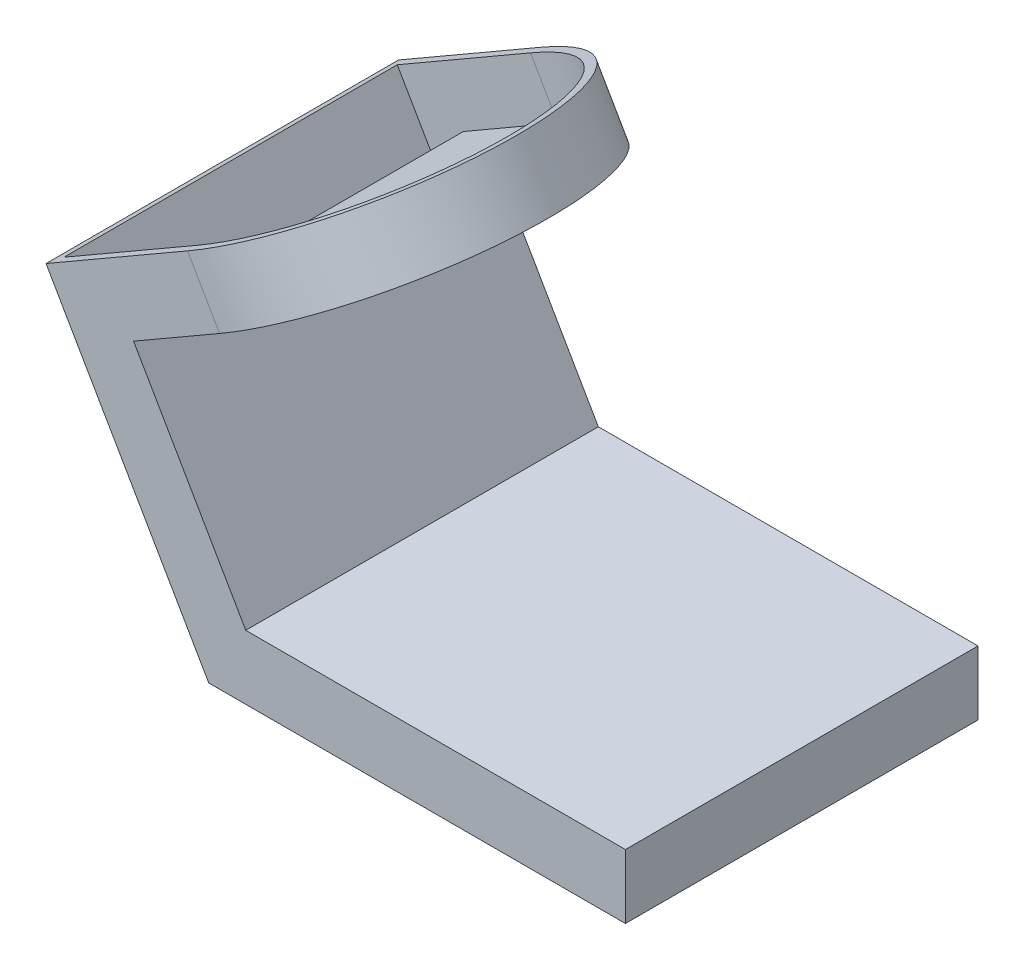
ISO-10303-21;
HEADER;
FILE_DESCRIPTION(('STEP AP214'),'2;1');
FILE_NAME('part.step','',(''),(''),'','','');
FILE_SCHEMA(('AUTOMOTIVE_DESIGN { 1 0 10303 214 1 1 1 1 }'));
ENDSEC;
DATA;
#1=APPLICATION_CONTEXT('core data for automotive mechanical design processes');
#2=APPLICATION_PROTOCOL_DEFINITION('international standard','automotive_design',2000,#1);
#3=PRODUCT_CONTEXT('',#1,'mechanical');
#4=PRODUCT('Part','Part','',(#3));
#5=PRODUCT_RELATED_PRODUCT_CATEGORY('part','',(#4));
#6=PRODUCT_DEFINITION_FORMATION('','',#4);
#7=PRODUCT_DEFINITION_CONTEXT('part definition',#1,'design');
#8=PRODUCT_DEFINITION('design','',#6,#7);
#9=PRODUCT_DEFINITION_SHAPE('','',#8);
#10=(LENGTH_UNIT() NAMED_UNIT(*) SI_UNIT(.MILLI.,.METRE.));
#11=(NAMED_UNIT(*) PLANE_ANGLE_UNIT() SI_UNIT($,.RADIAN.));
#12=(NAMED_UNIT(*) SI_UNIT($,.STERADIAN.) SOLID_ANGLE_UNIT());
#13=UNCERTAINTY_MEASURE_WITH_UNIT(LENGTH_MEASURE(1.E-05),#10,'distance_accuracy_value','');
#14=(GEOMETRIC_REPRESENTATION_CONTEXT(3) GLOBAL_UNCERTAINTY_ASSIGNED_CONTEXT((#13)) GLOBAL_UNIT_ASSIGNED_CONTEXT((#10,
#11,#12)) REPRESENTATION_CONTEXT('',''));
#15=CARTESIAN_POINT('',(0.,0.,0.));
#16=DIRECTION('',(0.,0.,1.));
#17=DIRECTION('',(1.,0.,0.));
#18=AXIS2_PLACEMENT_3D('',#15,#16,#17);
#19=CARTESIAN_POINT('',(-48.1711782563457,72.8516257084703,0.));
#20=DIRECTION('',(-0.500000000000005,0.866025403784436,0.));
#21=DIRECTION('',(-0.866025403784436,-0.500000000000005,0.));
#22=AXIS2_PLACEMENT_3D('',#19,#20,#21);
#23=CYLINDRICAL_SURFACE('',#22,9.50000000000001);
#24=CARTESIAN_POINT('',(-61.6062070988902,96.1217782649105,0.));
#25=DIRECTION('',(0.5,-0.866025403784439,0.));
#26=DIRECTION('',(0.866025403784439,0.5,0.));
#27=AXIS2_PLACEMENT_3D('',#24,#25,#26);
#28=CIRCLE('',#27,9.50000000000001);
#29=CARTESIAN_POINT('',(-53.378965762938,100.87177826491,0.));
#30=VERTEX_POINT('',#29);
#31=EDGE_CURVE('E192',#30,#30,#28,.F.);
#32=ORIENTED_EDGE('',*,*,#31,.F.);
#33=EDGE_LOOP('',(#32));
#34=FACE_BOUND('',#33,.T.);
#35=CARTESIAN_POINT('',(-63.1062070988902,98.7198544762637,0.));
#36=DIRECTION('',(-0.5,0.866025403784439,0.));
#37=DIRECTION('',(-0.866025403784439,-0.5,0.));
#38=AXIS2_PLACEMENT_3D('',#35,#36,#37);
#39=CIRCLE('',#38,9.50000000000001);
#40=CARTESIAN_POINT('',(-71.3334484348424,93.9698544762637,0.));
#41=VERTEX_POINT('',#40);
#42=EDGE_CURVE('E249',#41,#41,#39,.F.);
#43=ORIENTED_EDGE('',*,*,#42,.F.);
#44=EDGE_LOOP('',(#43));
#45=FACE_BOUND('',#44,.T.);
#46=ADVANCED_FACE('F45',(#34,#45),#23,.F.);
#47=CARTESIAN_POINT('',(-115.773502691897,87.9422863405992,-55.));
#48=DIRECTION('',(0.500000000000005,-0.866025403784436,0.));
#49=DIRECTION('',(0.866025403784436,0.500000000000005,0.));
#50=AXIS2_PLACEMENT_3D('',#47,#48,#49);
#51=PLANE('',#50);
#52=DIRECTION('',(0.866025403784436,0.500000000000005,0.));
#53=VECTOR('',#52,1.);
#54=CARTESIAN_POINT('',(-115.773502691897,87.9422863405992,55.));
#55=LINE('',#54,#53);
#56=CARTESIAN_POINT('',(-115.773502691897,87.9422863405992,55.));
#57=VERTEX_POINT('',#56);
#58=CARTESIAN_POINT('',(-71.6062070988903,113.442286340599,55.));
#59=VERTEX_POINT('',#58);
#60=EDGE_CURVE('E289',#57,#59,#55,.T.);
#61=ORIENTED_EDGE('',*,*,#60,.T.);
#62=CARTESIAN_POINT('',(-71.6062070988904,113.442286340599,0.));
#63=DIRECTION('',(-0.500000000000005,0.866025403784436,0.));
#64=DIRECTION('',(-0.866025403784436,-0.500000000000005,0.));
#65=AXIS2_PLACEMENT_3D('',#62,#63,#64);
#66=CIRCLE('',#65,55.);
#67=CARTESIAN_POINT('',(-71.6062070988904,113.442286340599,-55.));
#68=VERTEX_POINT('',#67);
#69=EDGE_CURVE('E253',#59,#68,#66,.T.);
#70=ORIENTED_EDGE('',*,*,#69,.T.);
#71=DIRECTION('',(0.866025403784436,0.500000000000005,0.));
#72=VECTOR('',#71,1.);
#73=CARTESIAN_POINT('',(-115.773502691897,87.9422863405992,-55.));
#74=LINE('',#73,#72);
#75=CARTESIAN_POINT('',(-115.773502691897,87.9422863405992,-55.));
#76=VERTEX_POINT('',#75);
#77=EDGE_CURVE('E278',#76,#68,#74,.T.);
#78=ORIENTED_EDGE('',*,*,#77,.F.);
#79=DIRECTION('',(0.,0.,1.));
#80=VECTOR('',#79,1.);
#81=CARTESIAN_POINT('',(-115.773502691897,87.9422863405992,-55.));
#82=LINE('',#81,#80);
#83=EDGE_CURVE('E295',#76,#57,#82,.T.);
#84=ORIENTED_EDGE('',*,*,#83,.T.);
#85=EDGE_LOOP('',(#61,#70,#78,#84));
#86=FACE_BOUND('',#85,.T.);
#87=DIRECTION('',(0.866025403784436,0.500000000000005,0.));
#88=VECTOR('',#87,1.);
#89=CARTESIAN_POINT('',(-115.773502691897,87.9422863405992,52.));
#90=LINE('',#89,#88);
#91=CARTESIAN_POINT('',(-113.175426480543,89.4422863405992,52.));
#92=VERTEX_POINT('',#91);
#93=CARTESIAN_POINT('',(-71.6062070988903,113.442286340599,52.));
#94=VERTEX_POINT('',#93);
#95=EDGE_CURVE('E224',#92,#94,#90,.T.);
#96=ORIENTED_EDGE('',*,*,#95,.F.);
#97=DIRECTION('',(0.,0.,1.));
#98=VECTOR('',#97,1.);
#99=CARTESIAN_POINT('',(-113.175426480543,89.4422863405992,-55.));
#100=LINE('',#99,#98);
#101=CARTESIAN_POINT('',(-113.175426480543,89.4422863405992,-52.));
#102=VERTEX_POINT('',#101);
#103=EDGE_CURVE('E240',#102,#92,#100,.T.);
#104=ORIENTED_EDGE('',*,*,#103,.F.);
#105=DIRECTION('',(0.866025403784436,0.500000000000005,0.));
#106=VECTOR('',#105,1.);
#107=CARTESIAN_POINT('',(-107.113248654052,92.9422863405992,-52.));
#108=LINE('',#107,#106);
#109=CARTESIAN_POINT('',(-71.6062070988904,113.442286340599,-52.));
#110=VERTEX_POINT('',#109);
#111=EDGE_CURVE('E61',#102,#110,#108,.T.);
#112=ORIENTED_EDGE('',*,*,#111,.T.);
#113=CARTESIAN_POINT('',(-71.6062070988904,113.442286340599,0.));
#114=DIRECTION('',(0.500000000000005,-0.866025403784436,0.));
#115=DIRECTION('',(0.866025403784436,0.500000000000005,0.));
#116=AXIS2_PLACEMENT_3D('',#113,#114,#115);
#117=CIRCLE('',#116,52.);
#118=EDGE_CURVE('E237',#94,#110,#117,.F.);
#119=ORIENTED_EDGE('',*,*,#118,.F.);
#120=EDGE_LOOP('',(#96,#104,#112,#119));
#121=FACE_BOUND('',#120,.T.);
#122=ADVANCED_FACE('F351',(#86,#121),#51,.F.);
#123=CARTESIAN_POINT('',(0.,20.,0.));
#124=DIRECTION('',(0.,1.,0.));
#125=DIRECTION('',(0.,0.,1.));
#126=AXIS2_PLACEMENT_3D('',#123,#124,#125);
#127=PLANE('',#126);
#128=DIRECTION('',(-1.,0.,0.));
#129=VECTOR('',#128,1.);
#130=CARTESIAN_POINT('',(-65.,20.,-55.));
#131=LINE('',#130,#129);
#132=CARTESIAN_POINT('',(65.,20.,-55.));
#133=VERTEX_POINT('',#132);
#134=CARTESIAN_POINT('',(-53.4529946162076,20.,-55.));
#135=VERTEX_POINT('',#134);
#136=EDGE_CURVE('E307',#133,#135,#131,.T.);
#137=ORIENTED_EDGE('',*,*,#136,.T.);
#138=DIRECTION('',(0.,0.,1.));
#139=VECTOR('',#138,1.);
#140=CARTESIAN_POINT('',(-53.4529946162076,20.,-55.));
#141=LINE('',#140,#139);
#142=CARTESIAN_POINT('',(-53.4529946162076,20.,55.));
#143=VERTEX_POINT('',#142);
#144=EDGE_CURVE('E286',#135,#143,#141,.T.);
#145=ORIENTED_EDGE('',*,*,#144,.T.);
#146=DIRECTION('',(1.,0.,0.));
#147=VECTOR('',#146,1.);
#148=CARTESIAN_POINT('',(-65.,20.,55.));
#149=LINE('',#148,#147);
#150=CARTESIAN_POINT('',(65.,20.,55.));
#151=VERTEX_POINT('',#150);
#152=EDGE_CURVE('E312',#143,#151,#149,.T.);
#153=ORIENTED_EDGE('',*,*,#152,.T.);
#154=DIRECTION('',(0.,0.,-1.));
#155=VECTOR('',#154,1.);
#156=CARTESIAN_POINT('',(65.,20.,-55.));
#157=LINE('',#156,#155);
#158=EDGE_CURVE('E303',#151,#133,#157,.T.);
#159=ORIENTED_EDGE('',*,*,#158,.T.);
#160=EDGE_LOOP('',(#137,#145,#153,#159));
#161=FACE_BOUND('',#160,.T.);
#162=ADVANCED_FACE('F361',(#161),#127,.T.);
#163=CARTESIAN_POINT('',(65.,20.,-55.));
#164=DIRECTION('',(-1.,0.,0.));
#165=DIRECTION('',(0.,0.,1.));
#166=AXIS2_PLACEMENT_3D('',#163,#164,#165);
#167=PLANE('',#166);
#168=DIRECTION('',(0.,0.,-1.));
#169=VECTOR('',#168,1.);
#170=CARTESIAN_POINT('',(65.,0.,-55.));
#171=LINE('',#170,#169);
#172=CARTESIAN_POINT('',(65.,0.,55.));
#173=VERTEX_POINT('',#172);
#174=CARTESIAN_POINT('',(65.,0.,-55.));
#175=VERTEX_POINT('',#174);
#176=EDGE_CURVE('E299',#173,#175,#171,.T.);
#177=ORIENTED_EDGE('',*,*,#176,.T.);
#178=DIRECTION('',(0.,-1.,0.));
#179=VECTOR('',#178,1.);
#180=CARTESIAN_POINT('',(65.,20.,-55.));
#181=LINE('',#180,#179);
#182=EDGE_CURVE('E54',#133,#175,#181,.T.);
#183=ORIENTED_EDGE('',*,*,#182,.F.);
#184=ORIENTED_EDGE('',*,*,#158,.F.);
#185=DIRECTION('',(0.,-1.,0.));
#186=VECTOR('',#185,1.);
#187=CARTESIAN_POINT('',(65.,20.,55.));
#188=LINE('',#187,#186);
#189=EDGE_CURVE('E315',#151,#173,#188,.T.);
#190=ORIENTED_EDGE('',*,*,#189,.T.);
#191=EDGE_LOOP('',(#177,#183,#184,#190));
#192=FACE_BOUND('',#191,.T.);
#193=ADVANCED_FACE('F47',(#192),#167,.F.);
#194=CARTESIAN_POINT('',(-65.,20.,-55.));
#195=DIRECTION('',(0.,0.,1.));
#196=DIRECTION('',(1.,0.,0.));
#197=AXIS2_PLACEMENT_3D('',#194,#195,#196);
#198=PLANE('',#197);
#199=DIRECTION('',(-0.500000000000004,0.866025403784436,0.));
#200=VECTOR('',#199,1.);
#201=CARTESIAN_POINT('',(-65.,0.,-55.));
#202=LINE('',#201,#200);
#203=CARTESIAN_POINT('',(-65.,0.,-55.));
#204=VERTEX_POINT('',#203);
#205=EDGE_CURVE('E283',#204,#76,#202,.T.);
#206=ORIENTED_EDGE('',*,*,#205,.T.);
#207=ORIENTED_EDGE('',*,*,#77,.T.);
#208=DIRECTION('',(-0.5,0.866025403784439,0.));
#209=VECTOR('',#208,1.);
#210=CARTESIAN_POINT('',(-71.6062070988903,113.442286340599,-55.));
#211=LINE('',#210,#209);
#212=CARTESIAN_POINT('',(-61.6062070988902,96.1217782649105,-55.));
#213=VERTEX_POINT('',#212);
#214=EDGE_CURVE('E265',#213,#68,#211,.T.);
#215=ORIENTED_EDGE('',*,*,#214,.F.);
#216=DIRECTION('',(0.866025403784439,0.5,0.));
#217=VECTOR('',#216,1.);
#218=CARTESIAN_POINT('',(-105.773502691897,70.6217782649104,-55.));
#219=LINE('',#218,#217);
#220=CARTESIAN_POINT('',(-88.4529946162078,80.6217782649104,-55.));
#221=VERTEX_POINT('',#220);
#222=EDGE_CURVE('E261',#221,#213,#219,.T.);
#223=ORIENTED_EDGE('',*,*,#222,.F.);
#224=DIRECTION('',(0.500000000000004,-0.866025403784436,0.));
#225=VECTOR('',#224,1.);
#226=CARTESIAN_POINT('',(-53.4529946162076,20.,-55.));
#227=LINE('',#226,#225);
#228=EDGE_CURVE('E68',#221,#135,#227,.T.);
#229=ORIENTED_EDGE('',*,*,#228,.T.);
#230=ORIENTED_EDGE('',*,*,#136,.F.);
#231=ORIENTED_EDGE('',*,*,#182,.T.);
#232=DIRECTION('',(-1.,0.,0.));
#233=VECTOR('',#232,1.);
#234=CARTESIAN_POINT('',(-65.,0.,-55.));
#235=LINE('',#234,#233);
#236=EDGE_CURVE('E319',#175,#204,#235,.T.);
#237=ORIENTED_EDGE('',*,*,#236,.T.);
#238=EDGE_LOOP('',(#206,#207,#215,#223,#229,#230,#231,#237));
#239=FACE_BOUND('',#238,.T.);
#240=ADVANCED_FACE('F334',(#239),#198,.F.);
#241=CARTESIAN_POINT('',(-65.,20.,55.));
#242=DIRECTION('',(0.,0.,-1.));
#243=DIRECTION('',(-1.,0.,0.));
#244=AXIS2_PLACEMENT_3D('',#241,#242,#243);
#245=PLANE('',#244);
#246=DIRECTION('',(0.500000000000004,-0.866025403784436,0.));
#247=VECTOR('',#246,1.);
#248=CARTESIAN_POINT('',(-53.4529946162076,20.,55.));
#249=LINE('',#248,#247);
#250=CARTESIAN_POINT('',(-88.4529946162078,80.6217782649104,55.));
#251=VERTEX_POINT('',#250);
#252=EDGE_CURVE('E269',#251,#143,#249,.T.);
#253=ORIENTED_EDGE('',*,*,#252,.F.);
#254=DIRECTION('',(0.866025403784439,0.5,0.));
#255=VECTOR('',#254,1.);
#256=CARTESIAN_POINT('',(-105.773502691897,70.6217782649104,55.));
#257=LINE('',#256,#255);
#258=CARTESIAN_POINT('',(-61.6062070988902,96.1217782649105,55.));
#259=VERTEX_POINT('',#258);
#260=EDGE_CURVE('E260',#251,#259,#257,.T.);
#261=ORIENTED_EDGE('',*,*,#260,.T.);
#262=DIRECTION('',(-0.5,0.866025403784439,0.));
#263=VECTOR('',#262,1.);
#264=CARTESIAN_POINT('',(-71.6062070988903,113.442286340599,55.));
#265=LINE('',#264,#263);
#266=EDGE_CURVE('E266',#259,#59,#265,.T.);
#267=ORIENTED_EDGE('',*,*,#266,.T.);
#268=ORIENTED_EDGE('',*,*,#60,.F.);
#269=DIRECTION('',(-0.500000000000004,0.866025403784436,0.));
#270=VECTOR('',#269,1.);
#271=CARTESIAN_POINT('',(-65.,0.,55.));
#272=LINE('',#271,#270);
#273=CARTESIAN_POINT('',(-65.,0.,55.));
#274=VERTEX_POINT('',#273);
#275=EDGE_CURVE('E279',#274,#57,#272,.T.);
#276=ORIENTED_EDGE('',*,*,#275,.F.);
#277=DIRECTION('',(1.,0.,0.));
#278=VECTOR('',#277,1.);
#279=CARTESIAN_POINT('',(-65.,0.,55.));
#280=LINE('',#279,#278);
#281=EDGE_CURVE('E308',#274,#173,#280,.T.);
#282=ORIENTED_EDGE('',*,*,#281,.T.);
#283=ORIENTED_EDGE('',*,*,#189,.F.);
#284=ORIENTED_EDGE('',*,*,#152,.F.);
#285=EDGE_LOOP('',(#253,#261,#267,#268,#276,#282,#283,#284));
#286=FACE_BOUND('',#285,.T.);
#287=ADVANCED_FACE('F365',(#286),#245,.F.);
#288=CARTESIAN_POINT('',(0.,0.,0.));
#289=DIRECTION('',(0.,1.,0.));
#290=DIRECTION('',(0.,0.,1.));
#291=AXIS2_PLACEMENT_3D('',#288,#289,#290);
#292=PLANE('',#291);
#293=ORIENTED_EDGE('',*,*,#176,.F.);
#294=ORIENTED_EDGE('',*,*,#281,.F.);
#295=DIRECTION('',(0.,0.,1.));
#296=VECTOR('',#295,1.);
#297=CARTESIAN_POINT('',(-65.,0.,-55.));
#298=LINE('',#297,#296);
#299=EDGE_CURVE('E322',#204,#274,#298,.T.);
#300=ORIENTED_EDGE('',*,*,#299,.F.);
#301=ORIENTED_EDGE('',*,*,#236,.F.);
#302=EDGE_LOOP('',(#293,#294,#300,#301));
#303=FACE_BOUND('',#302,.T.);
#304=ADVANCED_FACE('F341',(#303),#292,.F.);
#305=CARTESIAN_POINT('',(-65.,0.,-55.));
#306=DIRECTION('',(0.866025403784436,0.500000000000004,0.));
#307=DIRECTION('',(-0.500000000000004,0.866025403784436,0.));
#308=AXIS2_PLACEMENT_3D('',#305,#306,#307);
#309=PLANE('',#308);
#310=ORIENTED_EDGE('',*,*,#275,.T.);
#311=ORIENTED_EDGE('',*,*,#83,.F.);
#312=ORIENTED_EDGE('',*,*,#205,.F.);
#313=ORIENTED_EDGE('',*,*,#299,.T.);
#314=EDGE_LOOP('',(#310,#311,#312,#313));
#315=FACE_BOUND('',#314,.T.);
#316=ADVANCED_FACE('F346',(#315),#309,.F.);
#317=CARTESIAN_POINT('',(-53.4529946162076,20.,-55.));
#318=DIRECTION('',(-0.866025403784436,-0.500000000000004,0.));
#319=DIRECTION('',(0.500000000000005,-0.866025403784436,0.));
#320=AXIS2_PLACEMENT_3D('',#317,#318,#319);
#321=PLANE('',#320);
#322=ORIENTED_EDGE('',*,*,#228,.F.);
#323=DIRECTION('',(0.,0.,1.));
#324=VECTOR('',#323,1.);
#325=CARTESIAN_POINT('',(-88.4529946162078,80.6217782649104,-55.));
#326=LINE('',#325,#324);
#327=EDGE_CURVE('E11',#221,#251,#326,.T.);
#328=ORIENTED_EDGE('',*,*,#327,.T.);
#329=ORIENTED_EDGE('',*,*,#252,.T.);
#330=ORIENTED_EDGE('',*,*,#144,.F.);
#331=EDGE_LOOP('',(#322,#328,#329,#330));
#332=FACE_BOUND('',#331,.T.);
#333=ADVANCED_FACE('F363',(#332),#321,.F.);
#334=CARTESIAN_POINT('',(-105.773502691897,70.6217782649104,-55.));
#335=DIRECTION('',(0.5,-0.866025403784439,0.));
#336=DIRECTION('',(0.866025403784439,0.5,0.));
#337=AXIS2_PLACEMENT_3D('',#334,#335,#336);
#338=PLANE('',#337);
#339=ORIENTED_EDGE('',*,*,#31,.T.);
#340=EDGE_LOOP('',(#339));
#341=FACE_BOUND('',#340,.T.);
#342=ORIENTED_EDGE('',*,*,#327,.F.);
#343=ORIENTED_EDGE('',*,*,#222,.T.);
#344=CARTESIAN_POINT('',(-61.6062070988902,96.1217782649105,0.));
#345=DIRECTION('',(0.5,-0.866025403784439,0.));
#346=DIRECTION('',(0.866025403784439,0.5,0.));
#347=AXIS2_PLACEMENT_3D('',#344,#345,#346);
#348=CIRCLE('',#347,55.);
#349=EDGE_CURVE('E257',#259,#213,#348,.F.);
#350=ORIENTED_EDGE('',*,*,#349,.F.);
#351=ORIENTED_EDGE('',*,*,#260,.F.);
#352=EDGE_LOOP('',(#342,#343,#350,#351));
#353=FACE_BOUND('',#352,.T.);
#354=ADVANCED_FACE('F359',(#341,#353),#338,.T.);
#355=CARTESIAN_POINT('',(-0.114337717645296,-10.3852637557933,0.));
#356=DIRECTION('',(-0.500000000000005,0.866025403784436,0.));
#357=DIRECTION('',(-0.866025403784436,-0.500000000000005,0.));
#358=AXIS2_PLACEMENT_3D('',#355,#356,#357);
#359=CYLINDRICAL_SURFACE('',#358,55.);
#360=ORIENTED_EDGE('',*,*,#266,.F.);
#361=ORIENTED_EDGE('',*,*,#349,.T.);
#362=ORIENTED_EDGE('',*,*,#214,.T.);
#363=ORIENTED_EDGE('',*,*,#69,.F.);
#364=EDGE_LOOP('',(#360,#361,#362,#363));
#365=FACE_BOUND('',#364,.T.);
#366=ADVANCED_FACE('F356',(#365),#359,.T.);
#367=CARTESIAN_POINT('',(0.,17.,0.));
#368=DIRECTION('',(0.,1.,0.));
#369=DIRECTION('',(0.,0.,1.));
#370=AXIS2_PLACEMENT_3D('',#367,#368,#369);
#371=PLANE('',#370);
#372=DIRECTION('',(-1.,0.,0.));
#373=VECTOR('',#372,1.);
#374=CARTESIAN_POINT('',(-65.,17.,-52.));
#375=LINE('',#374,#373);
#376=CARTESIAN_POINT('',(62.,17.,-52.));
#377=VERTEX_POINT('',#376);
#378=CARTESIAN_POINT('',(-55.1850454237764,17.,-52.));
#379=VERTEX_POINT('',#378);
#380=EDGE_CURVE('E161',#377,#379,#375,.T.);
#381=ORIENTED_EDGE('',*,*,#380,.F.);
#382=DIRECTION('',(0.,0.,-1.));
#383=VECTOR('',#382,1.);
#384=CARTESIAN_POINT('',(62.,17.,-55.));
#385=LINE('',#384,#383);
#386=CARTESIAN_POINT('',(62.,17.,52.));
#387=VERTEX_POINT('',#386);
#388=EDGE_CURVE('E165',#387,#377,#385,.T.);
#389=ORIENTED_EDGE('',*,*,#388,.F.);
#390=DIRECTION('',(1.,0.,0.));
#391=VECTOR('',#390,1.);
#392=CARTESIAN_POINT('',(-65.,17.,52.));
#393=LINE('',#392,#391);
#394=CARTESIAN_POINT('',(-55.1850454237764,17.,52.));
#395=VERTEX_POINT('',#394);
#396=EDGE_CURVE('E170',#395,#387,#393,.T.);
#397=ORIENTED_EDGE('',*,*,#396,.F.);
#398=DIRECTION('',(0.,0.,1.));
#399=VECTOR('',#398,1.);
#400=CARTESIAN_POINT('',(-55.1850454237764,17.,0.));
#401=LINE('',#400,#399);
#402=EDGE_CURVE('E167',#379,#395,#401,.T.);
#403=ORIENTED_EDGE('',*,*,#402,.F.);
#404=EDGE_LOOP('',(#381,#389,#397,#403));
#405=FACE_BOUND('',#404,.T.);
#406=ADVANCED_FACE('F163',(#405),#371,.F.);
#407=CARTESIAN_POINT('',(62.,20.,-55.));
#408=DIRECTION('',(-1.,0.,0.));
#409=DIRECTION('',(0.,0.,1.));
#410=AXIS2_PLACEMENT_3D('',#407,#408,#409);
#411=PLANE('',#410);
#412=DIRECTION('',(0.,0.,-1.));
#413=VECTOR('',#412,1.);
#414=CARTESIAN_POINT('',(62.,3.,-55.));
#415=LINE('',#414,#413);
#416=CARTESIAN_POINT('',(62.,3.,52.));
#417=VERTEX_POINT('',#416);
#418=CARTESIAN_POINT('',(62.,3.,-52.));
#419=VERTEX_POINT('',#418);
#420=EDGE_CURVE('E196',#417,#419,#415,.T.);
#421=ORIENTED_EDGE('',*,*,#420,.F.);
#422=DIRECTION('',(0.,-1.,0.));
#423=VECTOR('',#422,1.);
#424=CARTESIAN_POINT('',(62.,20.,52.));
#425=LINE('',#424,#423);
#426=EDGE_CURVE('E180',#387,#417,#425,.T.);
#427=ORIENTED_EDGE('',*,*,#426,.F.);
#428=ORIENTED_EDGE('',*,*,#388,.T.);
#429=DIRECTION('',(0.,-1.,0.));
#430=VECTOR('',#429,1.);
#431=CARTESIAN_POINT('',(62.,20.,-52.));
#432=LINE('',#431,#430);
#433=EDGE_CURVE('E177',#377,#419,#432,.T.);
#434=ORIENTED_EDGE('',*,*,#433,.T.);
#435=EDGE_LOOP('',(#421,#427,#428,#434));
#436=FACE_BOUND('',#435,.T.);
#437=ADVANCED_FACE('F176',(#436),#411,.T.);
#438=CARTESIAN_POINT('',(-65.,20.,-52.));
#439=DIRECTION('',(0.,0.,1.));
#440=DIRECTION('',(1.,0.,0.));
#441=AXIS2_PLACEMENT_3D('',#438,#439,#440);
#442=PLANE('',#441);
#443=DIRECTION('',(-0.500000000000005,0.866025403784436,0.));
#444=VECTOR('',#443,1.);
#445=CARTESIAN_POINT('',(-0.114337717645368,-10.3852637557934,-52.));
#446=LINE('',#445,#444);
#447=CARTESIAN_POINT('',(-63.1062070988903,98.7198544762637,-52.));
#448=VERTEX_POINT('',#447);
#449=EDGE_CURVE('E201',#448,#110,#446,.T.);
#450=ORIENTED_EDGE('',*,*,#449,.T.);
#451=ORIENTED_EDGE('',*,*,#111,.F.);
#452=DIRECTION('',(-0.500000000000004,0.866025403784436,0.));
#453=VECTOR('',#452,1.);
#454=CARTESIAN_POINT('',(-71.0621778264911,16.4999999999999,-52.));
#455=LINE('',#454,#453);
#456=CARTESIAN_POINT('',(-63.2679491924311,3.,-52.));
#457=VERTEX_POINT('',#456);
#458=EDGE_CURVE('E198',#457,#102,#455,.T.);
#459=ORIENTED_EDGE('',*,*,#458,.F.);
#460=DIRECTION('',(-1.,0.,0.));
#461=VECTOR('',#460,1.);
#462=CARTESIAN_POINT('',(-65.,3.,-52.));
#463=LINE('',#462,#461);
#464=EDGE_CURVE('E185',#419,#457,#463,.T.);
#465=ORIENTED_EDGE('',*,*,#464,.F.);
#466=ORIENTED_EDGE('',*,*,#433,.F.);
#467=ORIENTED_EDGE('',*,*,#380,.T.);
#468=DIRECTION('',(0.500000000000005,-0.866025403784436,0.));
#469=VECTOR('',#468,1.);
#470=CARTESIAN_POINT('',(-58.937822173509,23.5,-52.));
#471=LINE('',#470,#469);
#472=CARTESIAN_POINT('',(-92.5510708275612,81.7198544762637,-52.));
#473=VERTEX_POINT('',#472);
#474=EDGE_CURVE('E210',#473,#379,#471,.T.);
#475=ORIENTED_EDGE('',*,*,#474,.F.);
#476=DIRECTION('',(0.866025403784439,0.5,0.));
#477=VECTOR('',#476,1.);
#478=CARTESIAN_POINT('',(-98.6132486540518,78.219854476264,-52.));
#479=LINE('',#478,#477);
#480=EDGE_CURVE('E205',#473,#448,#479,.T.);
#481=ORIENTED_EDGE('',*,*,#480,.T.);
#482=EDGE_LOOP('',(#450,#451,#459,#465,#466,#467,#475,#481));
#483=FACE_BOUND('',#482,.T.);
#484=ADVANCED_FACE('F184',(#483),#442,.T.);
#485=CARTESIAN_POINT('',(-65.,20.,52.));
#486=DIRECTION('',(0.,0.,-1.));
#487=DIRECTION('',(-1.,0.,0.));
#488=AXIS2_PLACEMENT_3D('',#485,#486,#487);
#489=PLANE('',#488);
#490=DIRECTION('',(0.866025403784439,0.5,0.));
#491=VECTOR('',#490,1.);
#492=CARTESIAN_POINT('',(-107.273502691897,73.2198544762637,52.));
#493=LINE('',#492,#491);
#494=CARTESIAN_POINT('',(-92.5510708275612,81.7198544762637,52.));
#495=VERTEX_POINT('',#494);
#496=CARTESIAN_POINT('',(-63.1062070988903,98.7198544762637,52.));
#497=VERTEX_POINT('',#496);
#498=EDGE_CURVE('E225',#495,#497,#493,.T.);
#499=ORIENTED_EDGE('',*,*,#498,.F.);
#500=DIRECTION('',(0.500000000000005,-0.866025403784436,0.));
#501=VECTOR('',#500,1.);
#502=CARTESIAN_POINT('',(-56.0510708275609,18.5,52.));
#503=LINE('',#502,#501);
#504=EDGE_CURVE('E204',#495,#395,#503,.T.);
#505=ORIENTED_EDGE('',*,*,#504,.T.);
#506=ORIENTED_EDGE('',*,*,#396,.T.);
#507=ORIENTED_EDGE('',*,*,#426,.T.);
#508=DIRECTION('',(1.,0.,0.));
#509=VECTOR('',#508,1.);
#510=CARTESIAN_POINT('',(-65.,3.,52.));
#511=LINE('',#510,#509);
#512=CARTESIAN_POINT('',(-63.2679491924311,3.,52.));
#513=VERTEX_POINT('',#512);
#514=EDGE_CURVE('E182',#513,#417,#511,.T.);
#515=ORIENTED_EDGE('',*,*,#514,.F.);
#516=DIRECTION('',(-0.500000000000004,0.866025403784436,0.));
#517=VECTOR('',#516,1.);
#518=CARTESIAN_POINT('',(-62.4019237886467,1.50000000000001,52.));
#519=LINE('',#518,#517);
#520=EDGE_CURVE('E213',#513,#92,#519,.T.);
#521=ORIENTED_EDGE('',*,*,#520,.T.);
#522=ORIENTED_EDGE('',*,*,#95,.T.);
#523=DIRECTION('',(-0.500000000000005,0.866025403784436,0.));
#524=VECTOR('',#523,1.);
#525=CARTESIAN_POINT('',(-0.114337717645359,-10.3852637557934,52.));
#526=LINE('',#525,#524);
#527=EDGE_CURVE('E209',#497,#94,#526,.T.);
#528=ORIENTED_EDGE('',*,*,#527,.F.);
#529=EDGE_LOOP('',(#499,#505,#506,#507,#515,#521,#522,#528));
#530=FACE_BOUND('',#529,.T.);
#531=ADVANCED_FACE('F481',(#530),#489,.T.);
#532=CARTESIAN_POINT('',(0.,3.,0.));
#533=DIRECTION('',(0.,1.,0.));
#534=DIRECTION('',(0.,0.,1.));
#535=AXIS2_PLACEMENT_3D('',#532,#533,#534);
#536=PLANE('',#535);
#537=ORIENTED_EDGE('',*,*,#420,.T.);
#538=ORIENTED_EDGE('',*,*,#464,.T.);
#539=DIRECTION('',(0.,0.,1.));
#540=VECTOR('',#539,1.);
#541=CARTESIAN_POINT('',(-63.2679491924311,3.,-55.));
#542=LINE('',#541,#540);
#543=EDGE_CURVE('E216',#457,#513,#542,.T.);
#544=ORIENTED_EDGE('',*,*,#543,.T.);
#545=ORIENTED_EDGE('',*,*,#514,.T.);
#546=EDGE_LOOP('',(#537,#538,#544,#545));
#547=FACE_BOUND('',#546,.T.);
#548=ADVANCED_FACE('F490',(#547),#536,.T.);
#549=CARTESIAN_POINT('',(-62.4019237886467,1.50000000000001,-55.));
#550=DIRECTION('',(0.866025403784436,0.500000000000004,0.));
#551=DIRECTION('',(-0.500000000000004,0.866025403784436,0.));
#552=AXIS2_PLACEMENT_3D('',#549,#550,#551);
#553=PLANE('',#552);
#554=ORIENTED_EDGE('',*,*,#520,.F.);
#555=ORIENTED_EDGE('',*,*,#543,.F.);
#556=ORIENTED_EDGE('',*,*,#458,.T.);
#557=ORIENTED_EDGE('',*,*,#103,.T.);
#558=EDGE_LOOP('',(#554,#555,#556,#557));
#559=FACE_BOUND('',#558,.T.);
#560=ADVANCED_FACE('F501',(#559),#553,.T.);
#561=CARTESIAN_POINT('',(-56.0510708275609,18.5,-55.));
#562=DIRECTION('',(-0.866025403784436,-0.500000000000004,0.));
#563=DIRECTION('',(0.500000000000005,-0.866025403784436,0.));
#564=AXIS2_PLACEMENT_3D('',#561,#562,#563);
#565=PLANE('',#564);
#566=ORIENTED_EDGE('',*,*,#474,.T.);
#567=ORIENTED_EDGE('',*,*,#402,.T.);
#568=ORIENTED_EDGE('',*,*,#504,.F.);
#569=DIRECTION('',(0.,0.,1.));
#570=VECTOR('',#569,1.);
#571=CARTESIAN_POINT('',(-92.5510708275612,81.7198544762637,-55.));
#572=LINE('',#571,#570);
#573=EDGE_CURVE('E187',#473,#495,#572,.T.);
#574=ORIENTED_EDGE('',*,*,#573,.F.);
#575=EDGE_LOOP('',(#566,#567,#568,#574));
#576=FACE_BOUND('',#575,.T.);
#577=ADVANCED_FACE('F511',(#576),#565,.T.);
#578=CARTESIAN_POINT('',(-107.273502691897,73.2198544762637,-55.));
#579=DIRECTION('',(0.5,-0.866025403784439,0.));
#580=DIRECTION('',(0.866025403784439,0.5,0.));
#581=AXIS2_PLACEMENT_3D('',#578,#579,#580);
#582=PLANE('',#581);
#583=ORIENTED_EDGE('',*,*,#573,.T.);
#584=ORIENTED_EDGE('',*,*,#498,.T.);
#585=CARTESIAN_POINT('',(-63.1062070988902,98.7198544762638,0.));
#586=DIRECTION('',(0.5,-0.866025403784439,0.));
#587=DIRECTION('',(0.866025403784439,0.5,0.));
#588=AXIS2_PLACEMENT_3D('',#585,#586,#587);
#589=CIRCLE('',#588,52.);
#590=EDGE_CURVE('E229',#497,#448,#589,.F.);
#591=ORIENTED_EDGE('',*,*,#590,.T.);
#592=ORIENTED_EDGE('',*,*,#480,.F.);
#593=EDGE_LOOP('',(#583,#584,#591,#592));
#594=FACE_BOUND('',#593,.T.);
#595=ORIENTED_EDGE('',*,*,#42,.T.);
#596=EDGE_LOOP('',(#595));
#597=FACE_BOUND('',#596,.T.);
#598=ADVANCED_FACE('F520',(#594,#597),#582,.F.);
#599=CARTESIAN_POINT('',(-0.114337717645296,-10.3852637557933,0.));
#600=DIRECTION('',(-0.500000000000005,0.866025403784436,0.));
#601=DIRECTION('',(-0.866025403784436,-0.500000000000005,0.));
#602=AXIS2_PLACEMENT_3D('',#599,#600,#601);
#603=CYLINDRICAL_SURFACE('',#602,52.);
#604=ORIENTED_EDGE('',*,*,#527,.T.);
#605=ORIENTED_EDGE('',*,*,#118,.T.);
#606=ORIENTED_EDGE('',*,*,#449,.F.);
#607=ORIENTED_EDGE('',*,*,#590,.F.);
#608=EDGE_LOOP('',(#604,#605,#606,#607));
#609=FACE_BOUND('',#608,.T.);
#610=ADVANCED_FACE('F386',(#609),#603,.F.);
#611=CLOSED_SHELL('',(#46,#122,#162,#193,#240,#287,#304,#316,#333,#354,#366,#406,#437,#484,#531,
#548,#560,#577,#598,#610));
#612=MANIFOLD_SOLID_BREP('B2',#611);
#613=ADVANCED_BREP_SHAPE_REPRESENTATION('',(#18,#612),#14);
#614=SHAPE_DEFINITION_REPRESENTATION(#9,#613);
ENDSEC;
END-ISO-10303-21;
